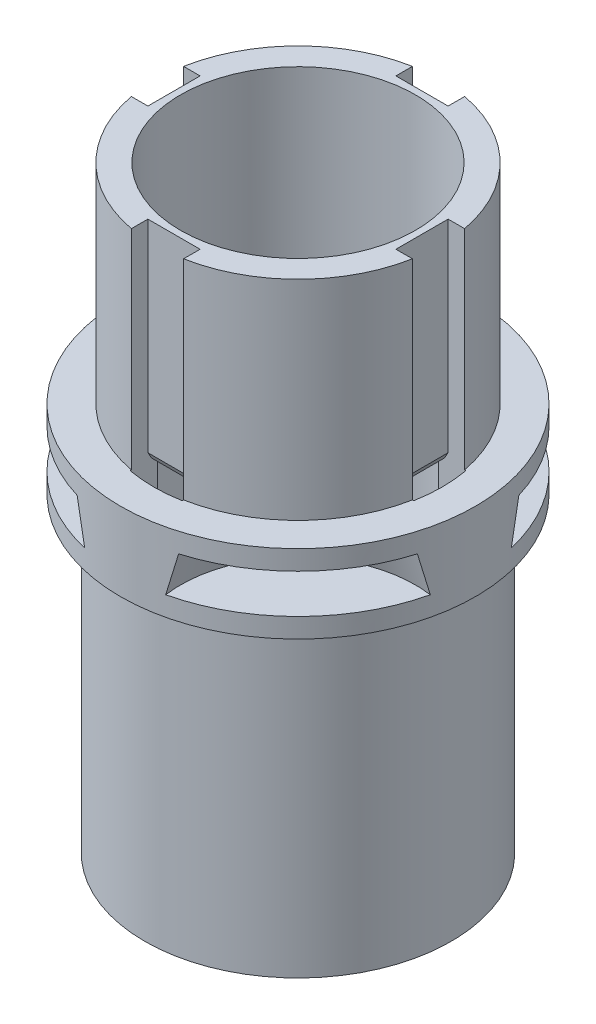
from build123d import *
from OCP.BRepFilletAPI import BRepFilletAPI_MakeChamfer

# Parameters (mm, degrees)
SKETCH1_R           = 11.74
BOSS_EXTRUDE1_DEPTH = 23.8
SKETCH2_R           = 13.6
BOSS_EXTRUDE2_DEPTH = 6
SKETCH3_R           = 10.95
BOSS_EXTRUDE3_DEPTH = 16
SKETCH4_R           = 9
CUT_EXTRUDE1_DEPTH  = 50.674540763
CIRPATTERN1_COUNT   = 4
CUT_EXTRUDE3_START  = -45.8
CUT_EXTRUDE3_DEPTH  = 17.5
CIRPATTERN2_COUNT   = 4
SKETCH9_W           = 4
SKETCH9_H           = 1.5
CUT_EXTRUDE4_DEPTH  = 2
CIRPATTERN3_COUNT   = 4
CHAMFER1_SIZE       = 1.3
CHAMFER1_SIZE2      = 0.75055535
CHAMFER2_SIZE       = 0.5
CHAMFER2_SIZE2      = 0.288675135


with BuildPart() as part:
    # Sketch1 → Boss-Extrude1 (new body)
    with BuildSketch(Plane(origin=(0, 0, 0), x_dir=(1, 0, 0), z_dir=(0, 1, 0))):
        with Locations(Location((0, 0, 0), (0, 0, 270))):
            Circle(SKETCH1_R)
    extrude(amount=BOSS_EXTRUDE1_DEPTH)

    # Sketch2 → Boss-Extrude2 (add)
    with BuildSketch(Plane(origin=(0, 23.8, 0), x_dir=(1, 0, 0), z_dir=(0, 1, 0))):
        with Locations(Location((0, 0, 0), (0, 0, 270))):
            Circle(SKETCH2_R)
    extrude(amount=BOSS_EXTRUDE2_DEPTH)

    # Sketch3 → Boss-Extrude3 (add)
    with BuildSketch(Plane(origin=(0, 29.8, 0), x_dir=(1, 0, 0), z_dir=(0, 1, 0))):
        with Locations(Location((0, 0, 0), (0, 0, 270))):
            Circle(SKETCH3_R)
    extrude(amount=BOSS_EXTRUDE3_DEPTH)

    # Sketch4 → Cut-Extrude1 (cut, through all)
    with BuildSketch(Plane(origin=(0, 45.8, 0), x_dir=(1, 0, 0), z_dir=(0, 1, 0))):
        with Locations(Location((0, 0, 0), (0, 0, 270))):
            Circle(SKETCH4_R)
    extrude(amount=-CUT_EXTRUDE1_DEPTH, mode=Mode.SUBTRACT)

    # Sketch7 → Cut-Revolve1 (revolve, cut)
    with BuildSketch(Plane(origin=(0, 0, 0), x_dir=(0.7071067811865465, 0, -0.7071067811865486), z_dir=(0.7071067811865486, 0, 0.7071067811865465))):
        Polygon((8, 25.3), (8.803847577, 28.3), (17, 28.3), (17, 25.3), align=None)
    cut_revolve1 = revolve(axis=Axis((12.02081528, 28.3, -12.02081528), (0, -1, 0)), mode=Mode.SUBTRACT)

    # CirPattern1: Cut-Revolve1 ×4 about axis
    cirpattern1_axis = Axis((0, 0, 0), (0, 1, 0))
    for i in range(1, CIRPATTERN1_COUNT):
        add(cut_revolve1.rotate(cirpattern1_axis, i * 360 / CIRPATTERN1_COUNT), mode=Mode.SUBTRACT)

    # Sketch8 → Cut-Extrude3 (cut)
    with BuildSketch(Plane.XZ.offset(CUT_EXTRUDE3_START)):
        with BuildLine():
            Line((2, 9.5), (2, 10.867497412))
            ThreePointArc((2, 10.867497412), (0, 11.05), (-2, 10.867497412))
            Line((-2, 10.867497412), (-2, 9.5))
            Line((-2, 9.5), (2, 9.5))
        make_face()
    cut_extrude3 = extrude(amount=CUT_EXTRUDE3_DEPTH, mode=Mode.SUBTRACT)

    # CirPattern2: Cut-Extrude3 ×4 about axis
    cirpattern2_axis = Axis((0, 0, 0), (0, 1, 0))
    for i in range(1, CIRPATTERN2_COUNT):
        add(cut_extrude3.rotate(cirpattern2_axis, i * 360 / CIRPATTERN2_COUNT), mode=Mode.SUBTRACT)

    # Sketch9 → Cut-Extrude4 (cut)
    with BuildSketch(Plane(origin=(9.5, 0, 0), x_dir=(0, 0, -1), z_dir=(1, 0, 0))):
        with Locations((0, 29.05)):
            Rectangle(SKETCH9_W, SKETCH9_H)
    cut_extrude4 = extrude(amount=-CUT_EXTRUDE4_DEPTH, mode=Mode.SUBTRACT)

    # CirPattern3: Cut-Extrude4 ×4 about axis
    cirpattern3_axis = Axis((0, 45.8, 0), (0, -1, 0))
    for i in range(1, CIRPATTERN3_COUNT):
        add(cut_extrude4.rotate(cirpattern3_axis, i * 360 / CIRPATTERN3_COUNT), mode=Mode.SUBTRACT)

    # Chamfer1: one chamfer whose edges measure the first distance from different faces: ONE call of the kernel's chamfer builder (chamfer() names one face for all edges)
    chamfer1_edges_1 = [part.edges().sort_by_distance(p)[0] for p in [
        (9, 28.3, 0),
    ]]
    chamfer1_side_1 = [part.faces().sort_by_distance(p)[0] for p in [
        (9.95699676, 28.3, 0),
    ]]
    chamfer1_edges_2 = [part.edges().sort_by_distance(p)[0] for p in [
        (-1.006310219, 28.3, 8.943564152),
    ]]
    chamfer1_side_2 = [part.faces().sort_by_distance(p)[0] for p in [
        (0, 28.3, 9.95699676),
    ]]
    chamfer1_edges_3 = [part.edges().sort_by_distance(p)[0] for p in [
        (-9, 28.3, 0),
    ]]
    chamfer1_side_3 = [part.faces().sort_by_distance(p)[0] for p in [
        (-9.95699676, 28.3, 0),
    ]]
    chamfer1_edges_4 = [part.edges().sort_by_distance(p)[0] for p in [
        (0, 28.3, -9),
    ]]
    chamfer1_side_4 = [part.faces().sort_by_distance(p)[0] for p in [
        (0, 28.3, -9.95699676),
    ]]
    chamfer1 = BRepFilletAPI_MakeChamfer(part.part.solid().wrapped)
    for e in chamfer1_edges_1:
        chamfer1.Add(CHAMFER1_SIZE, CHAMFER1_SIZE2, e.wrapped, chamfer1_side_1[0].wrapped)  # the first distance lies on this face
    for e in chamfer1_edges_2:
        chamfer1.Add(CHAMFER1_SIZE, CHAMFER1_SIZE2, e.wrapped, chamfer1_side_2[0].wrapped)  # the first distance lies on this face
    for e in chamfer1_edges_3:
        chamfer1.Add(CHAMFER1_SIZE, CHAMFER1_SIZE2, e.wrapped, chamfer1_side_3[0].wrapped)  # the first distance lies on this face
    for e in chamfer1_edges_4:
        chamfer1.Add(CHAMFER1_SIZE, CHAMFER1_SIZE2, e.wrapped, chamfer1_side_4[0].wrapped)  # the first distance lies on this face
    add(Compound.cast(chamfer1.Shape()), mode=Mode.REPLACE)

    # Chamfer2: one chamfer whose edges measure the first distance from different faces: ONE call of the kernel's chamfer builder (chamfer() names one face for all edges)
    chamfer2_edges_1 = [part.edges().sort_by_distance(p)[0] for p in [
        (9.5, 29.8, 0),
    ]]
    chamfer2_side_1 = [part.faces().sort_by_distance(p)[0] for p in [
        (9.5, 37.8, 0),
    ]]
    chamfer2_edges_2 = [part.edges().sort_by_distance(p)[0] for p in [
        (0, 29.8, 9.5),
    ]]
    chamfer2_side_2 = [part.faces().sort_by_distance(p)[0] for p in [
        (0, 37.8, 9.5),
    ]]
    chamfer2_edges_3 = [part.edges().sort_by_distance(p)[0] for p in [
        (-9.5, 29.8, 0),
    ]]
    chamfer2_side_3 = [part.faces().sort_by_distance(p)[0] for p in [
        (-9.5, 37.8, 0),
    ]]
    chamfer2_edges_4 = [part.edges().sort_by_distance(p)[0] for p in [
        (0, 29.8, -9.5),
    ]]
    chamfer2_side_4 = [part.faces().sort_by_distance(p)[0] for p in [
        (0, 37.8, -9.5),
    ]]
    chamfer2 = BRepFilletAPI_MakeChamfer(part.part.solid().wrapped)
    for e in chamfer2_edges_1:
        chamfer2.Add(CHAMFER2_SIZE, CHAMFER2_SIZE2, e.wrapped, chamfer2_side_1[0].wrapped)  # the first distance lies on this face
    for e in chamfer2_edges_2:
        chamfer2.Add(CHAMFER2_SIZE, CHAMFER2_SIZE2, e.wrapped, chamfer2_side_2[0].wrapped)  # the first distance lies on this face
    for e in chamfer2_edges_3:
        chamfer2.Add(CHAMFER2_SIZE, CHAMFER2_SIZE2, e.wrapped, chamfer2_side_3[0].wrapped)  # the first distance lies on this face
    for e in chamfer2_edges_4:
        chamfer2.Add(CHAMFER2_SIZE, CHAMFER2_SIZE2, e.wrapped, chamfer2_side_4[0].wrapped)  # the first distance lies on this face
    add(Compound.cast(chamfer2.Shape()), mode=Mode.REPLACE)


solid = part.part
